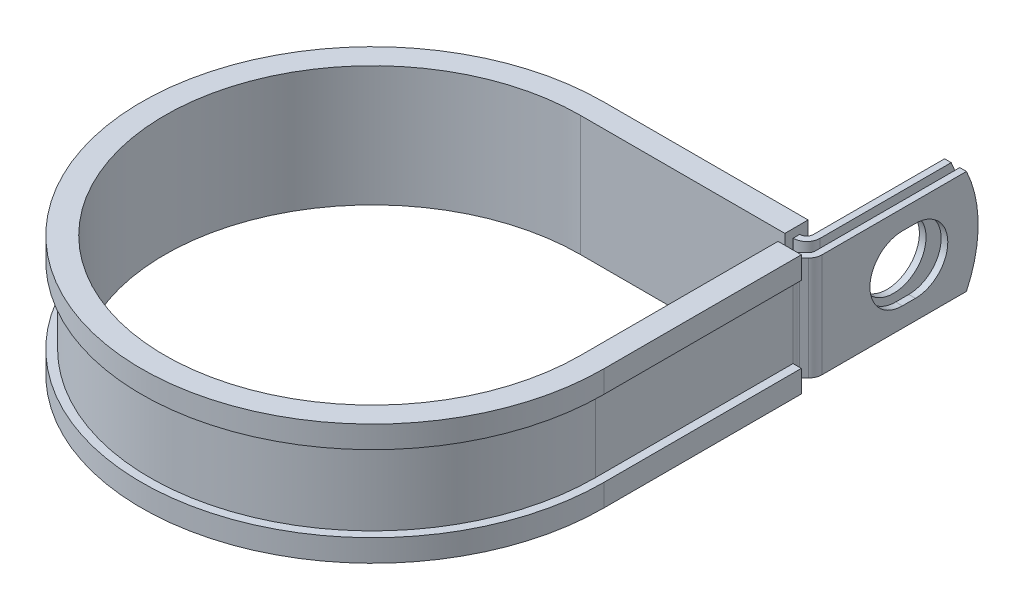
from build123d import *

# Parameters (mm, degrees)
EXTRUDE_THIN1_DEPTH = 9.525
SKETCH2_R           = 5.9436
CUT_EXTRUDE1_DEPTH  = 1.2192
CUT_EXTRUDE2_DEPTH  = 1.2192
CUT_EXTRUDE3_DEPTH  = 106.262777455


with BuildPart() as part:
    # Sketch1 → Extrude-Thin1 (new, symmetric)
    with BuildSketch(Plane(origin=(0, 0, 0), x_dir=(1, 0, 0), z_dir=(0, 1, 0))):
        with BuildLine():
            Line((41.5214698, 68.2498), (41.5214698, 39.624))
            ThreePointArc((41.5214698, 39.624), (41.428663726, 39.157432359), (41.164374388, 38.761895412))
            Line((41.164374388, 38.761895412), (40.338190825, 37.935711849))
            ThreePointArc((40.338190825, 37.935711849), (39.809612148, 37.144637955), (39.624, 36.211502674))
            Line((39.624, 36.211502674), (39.624, 0))
            ThreePointArc((39.624, 0), (-28.018399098, -28.018399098), (0, 39.624))
            Line((0, 39.624), (37.5082698, 39.624))
            ThreePointArc((37.5082698, 39.624), (39.232478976, 40.338190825), (39.9466698, 42.0624))
            Line((39.9466698, 42.0624), (39.9466698, 68.2498))
            Line((39.9466698, 68.2498), (38.7274698, 68.2498))
            Line((38.7274698, 68.2498), (38.7274698, 42.0624))
            ThreePointArc((38.7274698, 42.0624), (38.370374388, 41.200295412), (37.5082698, 40.8432))
            Line((37.5082698, 40.8432), (0, 40.8432))
            ThreePointArc((0, 40.8432), (-28.880503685, -28.880503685), (40.8432, 0))
            Line((40.8432, 0), (40.8432, 36.211502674))
            ThreePointArc((40.8432, 36.211502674), (40.936006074, 36.678070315), (41.200295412, 37.073607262))
            Line((41.200295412, 37.073607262), (42.026478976, 37.899790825))
            ThreePointArc((42.026478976, 37.899790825), (42.555057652, 38.690864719), (42.7406698, 39.624))
            Line((42.7406698, 39.624), (42.7406698, 68.2498))
            Line((42.7406698, 68.2498), (41.5214698, 68.2498))
        make_face()
    extrude(amount=EXTRUDE_THIN1_DEPTH, both=True)

    # Sketch2 → Cut-Extrude1 (cut)
    with BuildSketch(Plane.ZY.offset(-38.7274698)):
        with Locations((-55.5498, 0)):
            Circle(SKETCH2_R)
    extrude(amount=-CUT_EXTRUDE1_DEPTH, mode=Mode.SUBTRACT)

    # Sketch3 → Cut-Extrude2 (cut)
    with BuildSketch(Plane(origin=(42.7406698, 0, 0), x_dir=(0, 0, -1), z_dir=(1, 0, 0))):
        with BuildLine():
            Line((54.356, 5.9436), (56.7436, 5.9436))
            ThreePointArc((56.7436, 5.9436), (62.6872, 0), (56.7436, -5.9436))
            Line((56.7436, -5.9436), (54.356, -5.9436))
            ThreePointArc((54.356, -5.9436), (48.4124, 0), (54.356, 5.9436))
        make_face()
    extrude(amount=-CUT_EXTRUDE2_DEPTH, mode=Mode.SUBTRACT)

    # Sketch4 → Cut-Extrude3 (cut, through all)
    with BuildSketch(Plane.ZY.offset(-38.7274698)):
        with BuildLine():
            Line((-66.105263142, 9.525), (-68.2498, 9.525))
            Line((-68.2498, 9.525), (-68.2498, 0))
            ThreePointArc((-68.2498, 0), (-67.707038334, 4.881717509), (-66.105263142, 9.525))
        make_face()
        with BuildLine():
            ThreePointArc((-66.105263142, -9.525), (-67.707038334, -4.881717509), (-68.2498, 0))
            Line((-68.2498, 0), (-68.2498, -9.525))
            Line((-68.2498, -9.525), (-66.105263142, -9.525))
        make_face()
    extrude(amount=-CUT_EXTRUDE3_DEPTH, mode=Mode.SUBTRACT)

    # Sweep1: sweep along a path in Sketch6
    with BuildLine(Plane(origin=(0, 9.525, 0), x_dir=(1, 0, 0), z_dir=(0, 1, 0))) as sweep1_path:
        Line((38.1, 36.211502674), (38.1, 0))
        ThreePointArc((38.1, 0), (-26.940768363, -26.940768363), (0, 38.1))
        Line((0, 38.1), (37.4574698, 38.1))
    # Sketch5 → Sweep1 (sweep)
    with BuildSketch(Plane(origin=(0, 0, -36.211502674), x_dir=(-1, 0, 0), z_dir=(0, 0, -1))):
        Polygon((-40.8432, 9.525), (-39.624, 9.525), (-39.624, -9.525), (-40.8432, -9.525), (-40.8432, -6.985), (-42.3672, -6.985), (-42.3672, -11.049), (-38.1, -11.049), (-38.1, 11.049), (-42.3672, 11.049), (-42.3672, 6.985), (-40.8432, 6.985), align=None)
    sweep(path=sweep1_path.line)


solid = part.part
